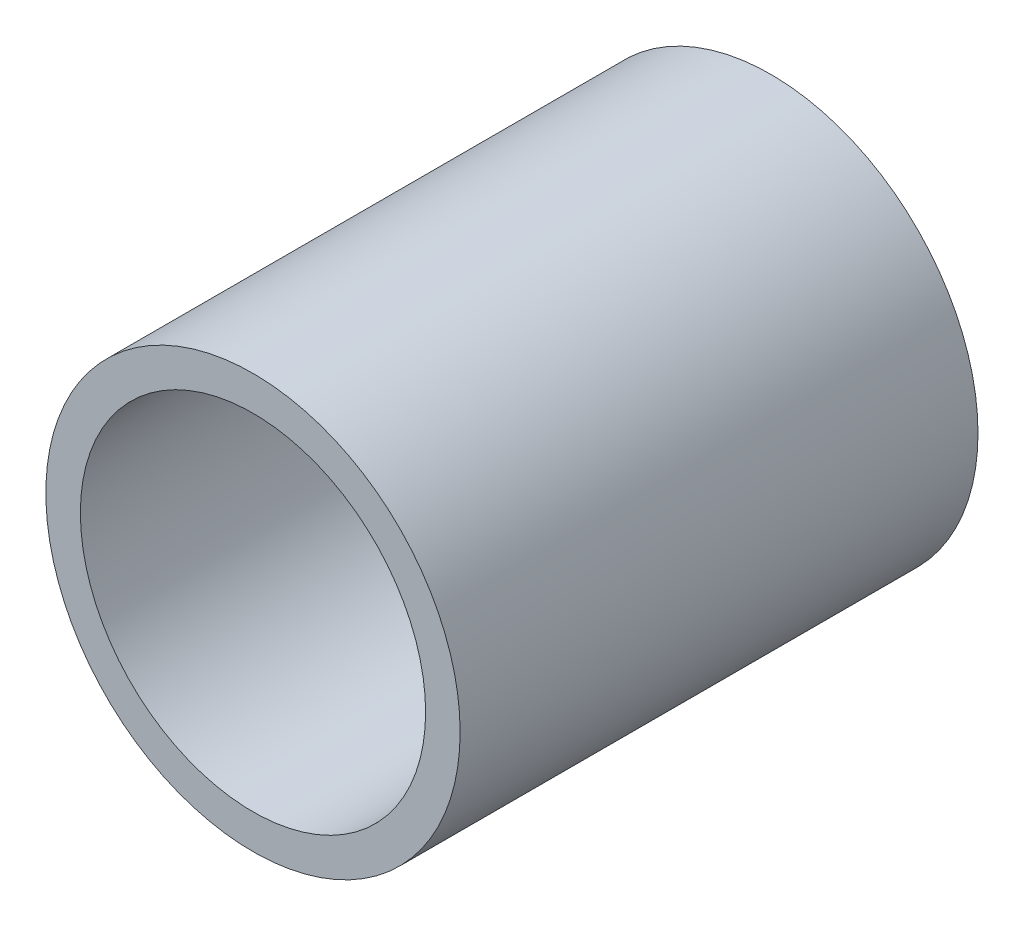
from build123d import *

# Parameters (mm, degrees)
SKIZZE3_R               = 60
SKIZZE3_R_2             = 50
LINEAR_AUSTRAGEN2_DEPTH = 150


with BuildPart() as part:
    # Skizze3 → Linear austragen2 (new body)
    with BuildSketch(Plane.XY.offset(150)):
        Circle(SKIZZE3_R)
        Circle(SKIZZE3_R_2, mode=Mode.SUBTRACT)
    extrude(amount=-LINEAR_AUSTRAGEN2_DEPTH)


solid = part.part
